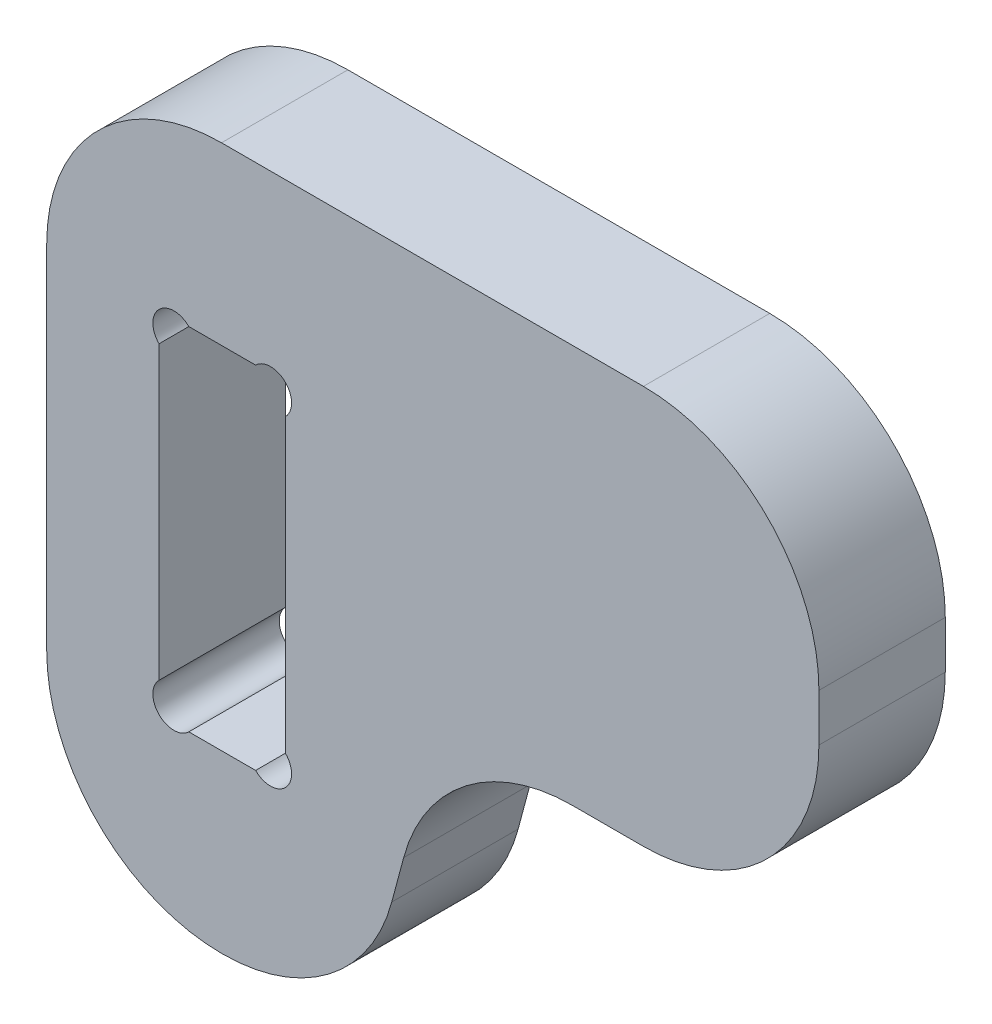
ISO-10303-21;
HEADER;
FILE_DESCRIPTION(('STEP AP214'),'2;1');
FILE_NAME('part.step','',(''),(''),'','','');
FILE_SCHEMA(('AUTOMOTIVE_DESIGN { 1 0 10303 214 1 1 1 1 }'));
ENDSEC;
DATA;
#1=APPLICATION_CONTEXT('core data for automotive mechanical design processes');
#2=APPLICATION_PROTOCOL_DEFINITION('international standard','automotive_design',2000,#1);
#3=PRODUCT_CONTEXT('',#1,'mechanical');
#4=PRODUCT('Part','Part','',(#3));
#5=PRODUCT_RELATED_PRODUCT_CATEGORY('part','',(#4));
#6=PRODUCT_DEFINITION_FORMATION('','',#4);
#7=PRODUCT_DEFINITION_CONTEXT('part definition',#1,'design');
#8=PRODUCT_DEFINITION('design','',#6,#7);
#9=PRODUCT_DEFINITION_SHAPE('','',#8);
#10=(LENGTH_UNIT() NAMED_UNIT(*) SI_UNIT(.MILLI.,.METRE.));
#11=(NAMED_UNIT(*) PLANE_ANGLE_UNIT() SI_UNIT($,.RADIAN.));
#12=(NAMED_UNIT(*) SI_UNIT($,.STERADIAN.) SOLID_ANGLE_UNIT());
#13=UNCERTAINTY_MEASURE_WITH_UNIT(LENGTH_MEASURE(1.E-05),#10,'distance_accuracy_value','');
#14=(GEOMETRIC_REPRESENTATION_CONTEXT(3) GLOBAL_UNCERTAINTY_ASSIGNED_CONTEXT((#13)) GLOBAL_UNIT_ASSIGNED_CONTEXT((#10,
#11,#12)) REPRESENTATION_CONTEXT('',''));
#15=CARTESIAN_POINT('',(0.,0.,0.));
#16=DIRECTION('',(0.,0.,1.));
#17=DIRECTION('',(1.,0.,0.));
#18=AXIS2_PLACEMENT_3D('',#15,#16,#17);
#19=CARTESIAN_POINT('',(24.9,-25.1,18.));
#20=DIRECTION('',(0.,0.,-1.));
#21=DIRECTION('',(-1.,0.,0.));
#22=AXIS2_PLACEMENT_3D('',#19,#20,#21);
#23=CYLINDRICAL_SURFACE('',#22,24.9);
#24=CARTESIAN_POINT('',(24.9,-25.1,0.));
#25=DIRECTION('',(0.,0.,1.));
#26=DIRECTION('',(-1.,0.,0.));
#27=AXIS2_PLACEMENT_3D('',#24,#25,#26);
#28=CIRCLE('',#27,24.9);
#29=CARTESIAN_POINT('',(0.,-25.1,0.));
#30=VERTEX_POINT('',#29);
#31=CARTESIAN_POINT('',(24.9000000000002,-50.,0.));
#32=VERTEX_POINT('',#31);
#33=EDGE_CURVE('E237',#30,#32,#28,.T.);
#34=ORIENTED_EDGE('',*,*,#33,.T.);
#35=DIRECTION('',(0.,0.,-1.));
#36=VECTOR('',#35,1.);
#37=CARTESIAN_POINT('',(24.9000000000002,-50.,18.));
#38=LINE('',#37,#36);
#39=CARTESIAN_POINT('',(24.9000000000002,-50.,18.));
#40=VERTEX_POINT('',#39);
#41=EDGE_CURVE('E276',#40,#32,#38,.T.);
#42=ORIENTED_EDGE('',*,*,#41,.F.);
#43=CARTESIAN_POINT('',(24.9,-25.1,18.));
#44=DIRECTION('',(0.,0.,1.));
#45=DIRECTION('',(-1.,0.,0.));
#46=AXIS2_PLACEMENT_3D('',#43,#44,#45);
#47=CIRCLE('',#46,24.9);
#48=CARTESIAN_POINT('',(0.,-25.1,18.));
#49=VERTEX_POINT('',#48);
#50=EDGE_CURVE('E214',#49,#40,#47,.T.);
#51=ORIENTED_EDGE('',*,*,#50,.F.);
#52=DIRECTION('',(0.,0.,-1.));
#53=VECTOR('',#52,1.);
#54=CARTESIAN_POINT('',(0.,-25.1,18.));
#55=LINE('',#54,#53);
#56=EDGE_CURVE('E279',#49,#30,#55,.T.);
#57=ORIENTED_EDGE('',*,*,#56,.T.);
#58=EDGE_LOOP('',(#34,#42,#51,#57));
#59=FACE_BOUND('',#58,.T.);
#60=ADVANCED_FACE('F33',(#59),#23,.T.);
#61=CARTESIAN_POINT('',(24.9000000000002,-50.,18.));
#62=DIRECTION('',(0.,1.,0.));
#63=DIRECTION('',(0.,0.,1.));
#64=AXIS2_PLACEMENT_3D('',#61,#62,#63);
#65=PLANE('',#64);
#66=DIRECTION('',(1.,0.,0.));
#67=VECTOR('',#66,1.);
#68=CARTESIAN_POINT('',(24.9000000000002,-50.,0.));
#69=LINE('',#68,#67);
#70=CARTESIAN_POINT('',(25.0999999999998,-50.,0.));
#71=VERTEX_POINT('',#70);
#72=EDGE_CURVE('E239',#32,#71,#69,.T.);
#73=ORIENTED_EDGE('',*,*,#72,.T.);
#74=DIRECTION('',(0.,0.,-1.));
#75=VECTOR('',#74,1.);
#76=CARTESIAN_POINT('',(25.0999999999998,-50.,18.));
#77=LINE('',#76,#75);
#78=CARTESIAN_POINT('',(25.0999999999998,-50.,18.));
#79=VERTEX_POINT('',#78);
#80=EDGE_CURVE('E273',#79,#71,#77,.T.);
#81=ORIENTED_EDGE('',*,*,#80,.F.);
#82=DIRECTION('',(1.,0.,0.));
#83=VECTOR('',#82,1.);
#84=CARTESIAN_POINT('',(24.9000000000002,-50.,18.));
#85=LINE('',#84,#83);
#86=EDGE_CURVE('E217',#40,#79,#85,.T.);
#87=ORIENTED_EDGE('',*,*,#86,.F.);
#88=ORIENTED_EDGE('',*,*,#41,.T.);
#89=EDGE_LOOP('',(#73,#81,#87,#88));
#90=FACE_BOUND('',#89,.T.);
#91=ADVANCED_FACE('F354',(#90),#65,.F.);
#92=CARTESIAN_POINT('',(25.1,-25.1,18.));
#93=DIRECTION('',(0.,0.,-1.));
#94=DIRECTION('',(-1.,0.,0.));
#95=AXIS2_PLACEMENT_3D('',#92,#93,#94);
#96=CYLINDRICAL_SURFACE('',#95,24.9);
#97=CARTESIAN_POINT('',(25.1,-25.1,0.));
#98=DIRECTION('',(0.,0.,1.));
#99=DIRECTION('',(1.,0.,0.));
#100=AXIS2_PLACEMENT_3D('',#97,#98,#99);
#101=CIRCLE('',#100,24.9);
#102=CARTESIAN_POINT('',(49.1520859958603,-31.5426050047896,0.));
#103=VERTEX_POINT('',#102);
#104=EDGE_CURVE('E242',#71,#103,#101,.T.);
#105=ORIENTED_EDGE('',*,*,#104,.T.);
#106=DIRECTION('',(0.,0.,-1.));
#107=VECTOR('',#106,1.);
#108=CARTESIAN_POINT('',(49.1520859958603,-31.5426050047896,18.));
#109=LINE('',#108,#107);
#110=CARTESIAN_POINT('',(49.1520859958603,-31.5426050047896,18.));
#111=VERTEX_POINT('',#110);
#112=EDGE_CURVE('E270',#111,#103,#109,.T.);
#113=ORIENTED_EDGE('',*,*,#112,.F.);
#114=CARTESIAN_POINT('',(25.1,-25.1,18.));
#115=DIRECTION('',(0.,0.,1.));
#116=DIRECTION('',(1.,0.,0.));
#117=AXIS2_PLACEMENT_3D('',#114,#115,#116);
#118=CIRCLE('',#117,24.9);
#119=EDGE_CURVE('E219',#79,#111,#118,.T.);
#120=ORIENTED_EDGE('',*,*,#119,.F.);
#121=ORIENTED_EDGE('',*,*,#80,.T.);
#122=EDGE_LOOP('',(#105,#113,#120,#121));
#123=FACE_BOUND('',#122,.T.);
#124=ADVANCED_FACE('F360',(#123),#96,.T.);
#125=CARTESIAN_POINT('',(49.1520859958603,-31.5426050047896,18.));
#126=DIRECTION('',(-0.965947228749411,0.258739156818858,0.));
#127=DIRECTION('',(-0.258739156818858,-0.965947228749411,0.));
#128=AXIS2_PLACEMENT_3D('',#125,#126,#127);
#129=PLANE('',#128);
#130=DIRECTION('',(0.258739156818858,0.965947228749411,0.));
#131=VECTOR('',#130,1.);
#132=CARTESIAN_POINT('',(49.1520859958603,-31.5426050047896,0.));
#133=LINE('',#132,#131);
#134=CARTESIAN_POINT('',(50.8479140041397,-25.2115943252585,0.));
#135=VERTEX_POINT('',#134);
#136=EDGE_CURVE('E244',#103,#135,#133,.T.);
#137=ORIENTED_EDGE('',*,*,#136,.T.);
#138=DIRECTION('',(0.,0.,-1.));
#139=VECTOR('',#138,1.);
#140=CARTESIAN_POINT('',(50.8479140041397,-25.2115943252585,18.));
#141=LINE('',#140,#139);
#142=CARTESIAN_POINT('',(50.8479140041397,-25.2115943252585,18.));
#143=VERTEX_POINT('',#142);
#144=EDGE_CURVE('E267',#143,#135,#141,.T.);
#145=ORIENTED_EDGE('',*,*,#144,.F.);
#146=DIRECTION('',(0.258739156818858,0.965947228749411,0.));
#147=VECTOR('',#146,1.);
#148=CARTESIAN_POINT('',(49.1520859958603,-31.5426050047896,18.));
#149=LINE('',#148,#147);
#150=EDGE_CURVE('E221',#111,#143,#149,.T.);
#151=ORIENTED_EDGE('',*,*,#150,.F.);
#152=ORIENTED_EDGE('',*,*,#112,.T.);
#153=EDGE_LOOP('',(#137,#145,#151,#152));
#154=FACE_BOUND('',#153,.T.);
#155=ADVANCED_FACE('F412',(#154),#129,.F.);
#156=CARTESIAN_POINT('',(74.9,-31.654199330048,18.));
#157=DIRECTION('',(0.,0.,-1.));
#158=DIRECTION('',(-1.,0.,0.));
#159=AXIS2_PLACEMENT_3D('',#156,#157,#158);
#160=CYLINDRICAL_SURFACE('',#159,24.9);
#161=CARTESIAN_POINT('',(74.9,-31.654199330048,0.));
#162=DIRECTION('',(0.,0.,-1.));
#163=DIRECTION('',(1.,0.,0.));
#164=AXIS2_PLACEMENT_3D('',#161,#162,#163);
#165=CIRCLE('',#164,24.9);
#166=CARTESIAN_POINT('',(74.9,-6.75419933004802,0.));
#167=VERTEX_POINT('',#166);
#168=EDGE_CURVE('E246',#135,#167,#165,.T.);
#169=ORIENTED_EDGE('',*,*,#168,.T.);
#170=DIRECTION('',(0.,0.,-1.));
#171=VECTOR('',#170,1.);
#172=CARTESIAN_POINT('',(74.9,-6.75419933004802,18.));
#173=LINE('',#172,#171);
#174=CARTESIAN_POINT('',(74.9,-6.75419933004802,18.));
#175=VERTEX_POINT('',#174);
#176=EDGE_CURVE('E264',#175,#167,#173,.T.);
#177=ORIENTED_EDGE('',*,*,#176,.F.);
#178=CARTESIAN_POINT('',(74.9,-31.654199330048,18.));
#179=DIRECTION('',(0.,0.,-1.));
#180=DIRECTION('',(1.,0.,0.));
#181=AXIS2_PLACEMENT_3D('',#178,#179,#180);
#182=CIRCLE('',#181,24.9);
#183=EDGE_CURVE('E223',#143,#175,#182,.T.);
#184=ORIENTED_EDGE('',*,*,#183,.F.);
#185=ORIENTED_EDGE('',*,*,#144,.T.);
#186=EDGE_LOOP('',(#169,#177,#184,#185));
#187=FACE_BOUND('',#186,.T.);
#188=ADVANCED_FACE('F417',(#187),#160,.F.);
#189=CARTESIAN_POINT('',(74.9,-6.75419933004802,18.));
#190=DIRECTION('',(0.,1.,0.));
#191=DIRECTION('',(0.,0.,1.));
#192=AXIS2_PLACEMENT_3D('',#189,#190,#191);
#193=PLANE('',#192);
#194=DIRECTION('',(1.,0.,0.));
#195=VECTOR('',#194,1.);
#196=CARTESIAN_POINT('',(74.9,-6.75419933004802,0.));
#197=LINE('',#196,#195);
#198=CARTESIAN_POINT('',(85.,-6.75419933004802,0.));
#199=VERTEX_POINT('',#198);
#200=EDGE_CURVE('E248',#167,#199,#197,.T.);
#201=ORIENTED_EDGE('',*,*,#200,.T.);
#202=DIRECTION('',(0.,0.,-1.));
#203=VECTOR('',#202,1.);
#204=CARTESIAN_POINT('',(85.,-6.75419933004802,18.));
#205=LINE('',#204,#203);
#206=CARTESIAN_POINT('',(85.,-6.75419933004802,18.));
#207=VERTEX_POINT('',#206);
#208=EDGE_CURVE('E291',#199,#207,#205,.F.);
#209=ORIENTED_EDGE('',*,*,#208,.T.);
#210=DIRECTION('',(1.,0.,0.));
#211=VECTOR('',#210,1.);
#212=CARTESIAN_POINT('',(74.9,-6.75419933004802,18.));
#213=LINE('',#212,#211);
#214=EDGE_CURVE('E225',#175,#207,#213,.T.);
#215=ORIENTED_EDGE('',*,*,#214,.F.);
#216=ORIENTED_EDGE('',*,*,#176,.T.);
#217=EDGE_LOOP('',(#201,#209,#215,#216));
#218=FACE_BOUND('',#217,.T.);
#219=ADVANCED_FACE('F420',(#218),#193,.F.);
#220=CARTESIAN_POINT('',(110.,50.,18.));
#221=DIRECTION('',(-1.,0.,0.));
#222=DIRECTION('',(0.,-1.,0.));
#223=AXIS2_PLACEMENT_3D('',#220,#221,#222);
#224=PLANE('',#223);
#225=DIRECTION('',(0.,1.,0.));
#226=VECTOR('',#225,1.);
#227=CARTESIAN_POINT('',(110.,50.,18.));
#228=LINE('',#227,#226);
#229=CARTESIAN_POINT('',(110.,18.245800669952,18.));
#230=VERTEX_POINT('',#229);
#231=CARTESIAN_POINT('',(110.,25.,18.));
#232=VERTEX_POINT('',#231);
#233=EDGE_CURVE('E228',#230,#232,#228,.T.);
#234=ORIENTED_EDGE('',*,*,#233,.F.);
#235=DIRECTION('',(0.,0.,-1.));
#236=VECTOR('',#235,1.);
#237=CARTESIAN_POINT('',(110.,18.245800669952,18.));
#238=LINE('',#237,#236);
#239=CARTESIAN_POINT('',(110.,18.245800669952,0.));
#240=VERTEX_POINT('',#239);
#241=EDGE_CURVE('E284',#230,#240,#238,.T.);
#242=ORIENTED_EDGE('',*,*,#241,.T.);
#243=DIRECTION('',(0.,1.,0.));
#244=VECTOR('',#243,1.);
#245=CARTESIAN_POINT('',(110.,50.,0.));
#246=LINE('',#245,#244);
#247=CARTESIAN_POINT('',(110.,25.,0.));
#248=VERTEX_POINT('',#247);
#249=EDGE_CURVE('E251',#240,#248,#246,.T.);
#250=ORIENTED_EDGE('',*,*,#249,.T.);
#251=DIRECTION('',(0.,0.,-1.));
#252=VECTOR('',#251,1.);
#253=CARTESIAN_POINT('',(110.,25.,18.));
#254=LINE('',#253,#252);
#255=EDGE_CURVE('E282',#248,#232,#254,.F.);
#256=ORIENTED_EDGE('',*,*,#255,.T.);
#257=EDGE_LOOP('',(#234,#242,#250,#256));
#258=FACE_BOUND('',#257,.T.);
#259=ADVANCED_FACE('F381',(#258),#224,.F.);
#260=CARTESIAN_POINT('',(24.9000000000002,50.,18.));
#261=DIRECTION('',(0.,-1.,0.));
#262=DIRECTION('',(1.,0.,0.));
#263=AXIS2_PLACEMENT_3D('',#260,#261,#262);
#264=PLANE('',#263);
#265=DIRECTION('',(-1.,0.,0.));
#266=VECTOR('',#265,1.);
#267=CARTESIAN_POINT('',(24.9000000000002,50.,18.));
#268=LINE('',#267,#266);
#269=CARTESIAN_POINT('',(85.,50.,18.));
#270=VERTEX_POINT('',#269);
#271=CARTESIAN_POINT('',(24.9000000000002,50.,18.));
#272=VERTEX_POINT('',#271);
#273=EDGE_CURVE('E231',#270,#272,#268,.T.);
#274=ORIENTED_EDGE('',*,*,#273,.F.);
#275=DIRECTION('',(0.,0.,-1.));
#276=VECTOR('',#275,1.);
#277=CARTESIAN_POINT('',(85.,50.,18.));
#278=LINE('',#277,#276);
#279=CARTESIAN_POINT('',(85.,50.,0.));
#280=VERTEX_POINT('',#279);
#281=EDGE_CURVE('E182',#270,#280,#278,.T.);
#282=ORIENTED_EDGE('',*,*,#281,.T.);
#283=DIRECTION('',(-1.,0.,0.));
#284=VECTOR('',#283,1.);
#285=CARTESIAN_POINT('',(24.9000000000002,50.,0.));
#286=LINE('',#285,#284);
#287=CARTESIAN_POINT('',(24.9000000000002,50.,0.));
#288=VERTEX_POINT('',#287);
#289=EDGE_CURVE('E254',#280,#288,#286,.T.);
#290=ORIENTED_EDGE('',*,*,#289,.T.);
#291=DIRECTION('',(0.,0.,-1.));
#292=VECTOR('',#291,1.);
#293=CARTESIAN_POINT('',(24.9000000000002,50.,18.));
#294=LINE('',#293,#292);
#295=EDGE_CURVE('E261',#272,#288,#294,.T.);
#296=ORIENTED_EDGE('',*,*,#295,.F.);
#297=EDGE_LOOP('',(#274,#282,#290,#296));
#298=FACE_BOUND('',#297,.T.);
#299=ADVANCED_FACE('F388',(#298),#264,.F.);
#300=CARTESIAN_POINT('',(24.9,25.1,18.));
#301=DIRECTION('',(0.,0.,-1.));
#302=DIRECTION('',(-1.,0.,0.));
#303=AXIS2_PLACEMENT_3D('',#300,#301,#302);
#304=CYLINDRICAL_SURFACE('',#303,24.9);
#305=CARTESIAN_POINT('',(24.9,25.1,0.));
#306=DIRECTION('',(0.,0.,1.));
#307=DIRECTION('',(-1.,0.,0.));
#308=AXIS2_PLACEMENT_3D('',#305,#306,#307);
#309=CIRCLE('',#308,24.9);
#310=CARTESIAN_POINT('',(0.,25.0999999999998,0.));
#311=VERTEX_POINT('',#310);
#312=EDGE_CURVE('E256',#288,#311,#309,.T.);
#313=ORIENTED_EDGE('',*,*,#312,.T.);
#314=DIRECTION('',(0.,0.,-1.));
#315=VECTOR('',#314,1.);
#316=CARTESIAN_POINT('',(0.,25.0999999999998,18.));
#317=LINE('',#316,#315);
#318=CARTESIAN_POINT('',(0.,25.0999999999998,18.));
#319=VERTEX_POINT('',#318);
#320=EDGE_CURVE('E236',#319,#311,#317,.T.);
#321=ORIENTED_EDGE('',*,*,#320,.F.);
#322=CARTESIAN_POINT('',(24.9,25.1,18.));
#323=DIRECTION('',(0.,0.,1.));
#324=DIRECTION('',(-1.,0.,0.));
#325=AXIS2_PLACEMENT_3D('',#322,#323,#324);
#326=CIRCLE('',#325,24.9);
#327=EDGE_CURVE('E233',#272,#319,#326,.T.);
#328=ORIENTED_EDGE('',*,*,#327,.F.);
#329=ORIENTED_EDGE('',*,*,#295,.T.);
#330=EDGE_LOOP('',(#313,#321,#328,#329));
#331=FACE_BOUND('',#330,.T.);
#332=ADVANCED_FACE('F394',(#331),#304,.T.);
#333=CARTESIAN_POINT('',(0.,0.,18.));
#334=DIRECTION('',(1.,0.,0.));
#335=DIRECTION('',(0.,0.,-1.));
#336=AXIS2_PLACEMENT_3D('',#333,#334,#335);
#337=PLANE('',#336);
#338=DIRECTION('',(0.,-1.,0.));
#339=VECTOR('',#338,1.);
#340=CARTESIAN_POINT('',(0.,0.,0.));
#341=LINE('',#340,#339);
#342=EDGE_CURVE('E215',#311,#30,#341,.T.);
#343=ORIENTED_EDGE('',*,*,#342,.T.);
#344=ORIENTED_EDGE('',*,*,#56,.F.);
#345=DIRECTION('',(0.,-1.,0.));
#346=VECTOR('',#345,1.);
#347=CARTESIAN_POINT('',(0.,0.,18.));
#348=LINE('',#347,#346);
#349=EDGE_CURVE('E211',#319,#49,#348,.T.);
#350=ORIENTED_EDGE('',*,*,#349,.F.);
#351=ORIENTED_EDGE('',*,*,#320,.T.);
#352=EDGE_LOOP('',(#343,#344,#350,#351));
#353=FACE_BOUND('',#352,.T.);
#354=ADVANCED_FACE('F398',(#353),#337,.F.);
#355=CARTESIAN_POINT('',(24.9,-25.1,18.));
#356=DIRECTION('',(0.,0.,-1.));
#357=DIRECTION('',(-1.,0.,0.));
#358=AXIS2_PLACEMENT_3D('',#355,#356,#357);
#359=PLANE('',#358);
#360=DIRECTION('',(1.,0.,0.));
#361=VECTOR('',#360,1.);
#362=CARTESIAN_POINT('',(0.,-25.,18.));
#363=LINE('',#362,#361);
#364=CARTESIAN_POINT('',(20.2426406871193,-25.,18.));
#365=VERTEX_POINT('',#364);
#366=CARTESIAN_POINT('',(29.7573593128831,-25.,18.));
#367=VERTEX_POINT('',#366);
#368=EDGE_CURVE('E199',#365,#367,#363,.T.);
#369=ORIENTED_EDGE('',*,*,#368,.F.);
#370=CARTESIAN_POINT('',(18.1213203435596,-22.8786796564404,18.));
#371=DIRECTION('',(0.,0.,1.));
#372=DIRECTION('',(-1.,0.,0.));
#373=AXIS2_PLACEMENT_3D('',#370,#371,#372);
#374=CIRCLE('',#373,3.);
#375=CARTESIAN_POINT('',(16.,-20.7573593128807,18.));
#376=VERTEX_POINT('',#375);
#377=EDGE_CURVE('E338',#376,#365,#374,.T.);
#378=ORIENTED_EDGE('',*,*,#377,.F.);
#379=DIRECTION('',(0.,1.,0.));
#380=VECTOR('',#379,1.);
#381=CARTESIAN_POINT('',(16.,0.,18.));
#382=LINE('',#381,#380);
#383=CARTESIAN_POINT('',(16.,20.7573593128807,18.));
#384=VERTEX_POINT('',#383);
#385=EDGE_CURVE('E201',#376,#384,#382,.T.);
#386=ORIENTED_EDGE('',*,*,#385,.T.);
#387=CARTESIAN_POINT('',(18.1213203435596,22.8786796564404,18.));
#388=DIRECTION('',(0.,0.,1.));
#389=DIRECTION('',(1.,0.,0.));
#390=AXIS2_PLACEMENT_3D('',#387,#388,#389);
#391=CIRCLE('',#390,3.);
#392=CARTESIAN_POINT('',(20.2426406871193,25.,18.));
#393=VERTEX_POINT('',#392);
#394=EDGE_CURVE('E300',#393,#384,#391,.T.);
#395=ORIENTED_EDGE('',*,*,#394,.F.);
#396=DIRECTION('',(1.,0.,0.));
#397=VECTOR('',#396,1.);
#398=CARTESIAN_POINT('',(0.,25.,18.));
#399=LINE('',#398,#397);
#400=CARTESIAN_POINT('',(29.7573593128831,25.,18.));
#401=VERTEX_POINT('',#400);
#402=EDGE_CURVE('E193',#393,#401,#399,.T.);
#403=ORIENTED_EDGE('',*,*,#402,.T.);
#404=CARTESIAN_POINT('',(31.8786796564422,22.8786796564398,18.));
#405=DIRECTION('',(0.,0.,1.));
#406=DIRECTION('',(-1.,0.,0.));
#407=AXIS2_PLACEMENT_3D('',#404,#405,#406);
#408=CIRCLE('',#407,3.);
#409=CARTESIAN_POINT('',(34.,20.7573593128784,18.));
#410=VERTEX_POINT('',#409);
#411=EDGE_CURVE('E174',#410,#401,#408,.T.);
#412=ORIENTED_EDGE('',*,*,#411,.F.);
#413=DIRECTION('',(0.,1.,0.));
#414=VECTOR('',#413,1.);
#415=CARTESIAN_POINT('',(34.,0.,18.));
#416=LINE('',#415,#414);
#417=CARTESIAN_POINT('',(34.,-20.7573593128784,18.));
#418=VERTEX_POINT('',#417);
#419=EDGE_CURVE('E191',#418,#410,#416,.T.);
#420=ORIENTED_EDGE('',*,*,#419,.F.);
#421=CARTESIAN_POINT('',(31.8786796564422,-22.8786796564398,18.));
#422=DIRECTION('',(0.,0.,1.));
#423=DIRECTION('',(1.,0.,0.));
#424=AXIS2_PLACEMENT_3D('',#421,#422,#423);
#425=CIRCLE('',#424,3.);
#426=EDGE_CURVE('E335',#367,#418,#425,.T.);
#427=ORIENTED_EDGE('',*,*,#426,.F.);
#428=EDGE_LOOP('',(#369,#378,#386,#395,#403,#412,#420,#427));
#429=FACE_BOUND('',#428,.T.);
#430=ORIENTED_EDGE('',*,*,#214,.T.);
#431=CARTESIAN_POINT('',(85.,18.245800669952,18.));
#432=DIRECTION('',(0.,0.,-1.));
#433=DIRECTION('',(-1.,0.,0.));
#434=AXIS2_PLACEMENT_3D('',#431,#432,#433);
#435=CIRCLE('',#434,25.);
#436=EDGE_CURVE('E295',#207,#230,#435,.F.);
#437=ORIENTED_EDGE('',*,*,#436,.T.);
#438=ORIENTED_EDGE('',*,*,#233,.T.);
#439=CARTESIAN_POINT('',(85.,25.,18.));
#440=DIRECTION('',(0.,0.,-1.));
#441=DIRECTION('',(-1.,0.,0.));
#442=AXIS2_PLACEMENT_3D('',#439,#440,#441);
#443=CIRCLE('',#442,25.);
#444=EDGE_CURVE('E293',#232,#270,#443,.F.);
#445=ORIENTED_EDGE('',*,*,#444,.T.);
#446=ORIENTED_EDGE('',*,*,#273,.T.);
#447=ORIENTED_EDGE('',*,*,#327,.T.);
#448=ORIENTED_EDGE('',*,*,#349,.T.);
#449=ORIENTED_EDGE('',*,*,#50,.T.);
#450=ORIENTED_EDGE('',*,*,#86,.T.);
#451=ORIENTED_EDGE('',*,*,#119,.T.);
#452=ORIENTED_EDGE('',*,*,#150,.T.);
#453=ORIENTED_EDGE('',*,*,#183,.T.);
#454=EDGE_LOOP('',(#430,#437,#438,#445,#446,#447,#448,#449,#450,#451,#452,#453));
#455=FACE_BOUND('',#454,.T.);
#456=ADVANCED_FACE('F188',(#429,#455),#359,.F.);
#457=CARTESIAN_POINT('',(24.9,-25.1,0.));
#458=DIRECTION('',(0.,0.,-1.));
#459=DIRECTION('',(-1.,0.,0.));
#460=AXIS2_PLACEMENT_3D('',#457,#458,#459);
#461=PLANE('',#460);
#462=CARTESIAN_POINT('',(18.1213203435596,-22.8786796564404,0.));
#463=DIRECTION('',(0.,0.,1.));
#464=DIRECTION('',(-1.,0.,0.));
#465=AXIS2_PLACEMENT_3D('',#462,#463,#464);
#466=CIRCLE('',#465,3.);
#467=CARTESIAN_POINT('',(16.,-20.7573593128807,0.));
#468=VERTEX_POINT('',#467);
#469=CARTESIAN_POINT('',(20.2426406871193,-25.,0.));
#470=VERTEX_POINT('',#469);
#471=EDGE_CURVE('E47',#468,#470,#466,.T.);
#472=ORIENTED_EDGE('',*,*,#471,.T.);
#473=DIRECTION('',(1.,0.,0.));
#474=VECTOR('',#473,1.);
#475=CARTESIAN_POINT('',(0.,-25.,0.));
#476=LINE('',#475,#474);
#477=CARTESIAN_POINT('',(29.7573593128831,-25.,0.));
#478=VERTEX_POINT('',#477);
#479=EDGE_CURVE('E210',#470,#478,#476,.T.);
#480=ORIENTED_EDGE('',*,*,#479,.T.);
#481=CARTESIAN_POINT('',(31.8786796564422,-22.8786796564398,0.));
#482=DIRECTION('',(0.,0.,1.));
#483=DIRECTION('',(1.,0.,0.));
#484=AXIS2_PLACEMENT_3D('',#481,#482,#483);
#485=CIRCLE('',#484,3.);
#486=CARTESIAN_POINT('',(34.,-20.7573593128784,0.));
#487=VERTEX_POINT('',#486);
#488=EDGE_CURVE('E194',#478,#487,#485,.T.);
#489=ORIENTED_EDGE('',*,*,#488,.T.);
#490=DIRECTION('',(0.,1.,0.));
#491=VECTOR('',#490,1.);
#492=CARTESIAN_POINT('',(34.,0.,0.));
#493=LINE('',#492,#491);
#494=CARTESIAN_POINT('',(34.,20.7573593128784,0.));
#495=VERTEX_POINT('',#494);
#496=EDGE_CURVE('E321',#487,#495,#493,.T.);
#497=ORIENTED_EDGE('',*,*,#496,.T.);
#498=CARTESIAN_POINT('',(31.8786796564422,22.8786796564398,0.));
#499=DIRECTION('',(0.,0.,1.));
#500=DIRECTION('',(-1.,0.,0.));
#501=AXIS2_PLACEMENT_3D('',#498,#499,#500);
#502=CIRCLE('',#501,3.);
#503=CARTESIAN_POINT('',(29.7573593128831,25.,0.));
#504=VERTEX_POINT('',#503);
#505=EDGE_CURVE('E176',#495,#504,#502,.T.);
#506=ORIENTED_EDGE('',*,*,#505,.T.);
#507=DIRECTION('',(1.,0.,0.));
#508=VECTOR('',#507,1.);
#509=CARTESIAN_POINT('',(0.,25.,0.));
#510=LINE('',#509,#508);
#511=CARTESIAN_POINT('',(20.2426406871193,25.,0.));
#512=VERTEX_POINT('',#511);
#513=EDGE_CURVE('E307',#512,#504,#510,.T.);
#514=ORIENTED_EDGE('',*,*,#513,.F.);
#515=CARTESIAN_POINT('',(18.1213203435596,22.8786796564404,0.));
#516=DIRECTION('',(0.,0.,1.));
#517=DIRECTION('',(1.,0.,0.));
#518=AXIS2_PLACEMENT_3D('',#515,#516,#517);
#519=CIRCLE('',#518,3.);
#520=CARTESIAN_POINT('',(16.,20.7573593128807,0.));
#521=VERTEX_POINT('',#520);
#522=EDGE_CURVE('E55',#512,#521,#519,.T.);
#523=ORIENTED_EDGE('',*,*,#522,.T.);
#524=DIRECTION('',(0.,1.,0.));
#525=VECTOR('',#524,1.);
#526=CARTESIAN_POINT('',(16.,0.,0.));
#527=LINE('',#526,#525);
#528=EDGE_CURVE('E240',#468,#521,#527,.T.);
#529=ORIENTED_EDGE('',*,*,#528,.F.);
#530=EDGE_LOOP('',(#472,#480,#489,#497,#506,#514,#523,#529));
#531=FACE_BOUND('',#530,.T.);
#532=ORIENTED_EDGE('',*,*,#249,.F.);
#533=CARTESIAN_POINT('',(85.,18.245800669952,0.));
#534=DIRECTION('',(0.,0.,-1.));
#535=DIRECTION('',(-1.,0.,0.));
#536=AXIS2_PLACEMENT_3D('',#533,#534,#535);
#537=CIRCLE('',#536,25.);
#538=EDGE_CURVE('E289',#240,#199,#537,.T.);
#539=ORIENTED_EDGE('',*,*,#538,.T.);
#540=ORIENTED_EDGE('',*,*,#200,.F.);
#541=ORIENTED_EDGE('',*,*,#168,.F.);
#542=ORIENTED_EDGE('',*,*,#136,.F.);
#543=ORIENTED_EDGE('',*,*,#104,.F.);
#544=ORIENTED_EDGE('',*,*,#72,.F.);
#545=ORIENTED_EDGE('',*,*,#33,.F.);
#546=ORIENTED_EDGE('',*,*,#342,.F.);
#547=ORIENTED_EDGE('',*,*,#312,.F.);
#548=ORIENTED_EDGE('',*,*,#289,.F.);
#549=CARTESIAN_POINT('',(85.,25.,0.));
#550=DIRECTION('',(0.,0.,-1.));
#551=DIRECTION('',(-1.,0.,0.));
#552=AXIS2_PLACEMENT_3D('',#549,#550,#551);
#553=CIRCLE('',#552,25.);
#554=EDGE_CURVE('E287',#280,#248,#553,.T.);
#555=ORIENTED_EDGE('',*,*,#554,.T.);
#556=EDGE_LOOP('',(#532,#539,#540,#541,#542,#543,#544,#545,#546,#547,#548,#555));
#557=FACE_BOUND('',#556,.T.);
#558=ADVANCED_FACE('F329',(#531,#557),#461,.T.);
#559=CARTESIAN_POINT('',(85.,18.245800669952,18.));
#560=DIRECTION('',(0.,0.,-1.));
#561=DIRECTION('',(-1.,0.,0.));
#562=AXIS2_PLACEMENT_3D('',#559,#560,#561);
#563=CYLINDRICAL_SURFACE('',#562,25.);
#564=ORIENTED_EDGE('',*,*,#436,.F.);
#565=ORIENTED_EDGE('',*,*,#208,.F.);
#566=ORIENTED_EDGE('',*,*,#538,.F.);
#567=ORIENTED_EDGE('',*,*,#241,.F.);
#568=EDGE_LOOP('',(#564,#565,#566,#567));
#569=FACE_BOUND('',#568,.T.);
#570=ADVANCED_FACE('F364',(#569),#563,.T.);
#571=CARTESIAN_POINT('',(85.,25.,18.));
#572=DIRECTION('',(0.,0.,-1.));
#573=DIRECTION('',(-1.,0.,0.));
#574=AXIS2_PLACEMENT_3D('',#571,#572,#573);
#575=CYLINDRICAL_SURFACE('',#574,25.);
#576=ORIENTED_EDGE('',*,*,#444,.F.);
#577=ORIENTED_EDGE('',*,*,#255,.F.);
#578=ORIENTED_EDGE('',*,*,#554,.F.);
#579=ORIENTED_EDGE('',*,*,#281,.F.);
#580=EDGE_LOOP('',(#576,#577,#578,#579));
#581=FACE_BOUND('',#580,.T.);
#582=ADVANCED_FACE('F35',(#581),#575,.T.);
#583=CARTESIAN_POINT('',(0.,-25.,0.));
#584=DIRECTION('',(0.,-1.,0.));
#585=DIRECTION('',(0.,0.,-1.));
#586=AXIS2_PLACEMENT_3D('',#583,#584,#585);
#587=PLANE('',#586);
#588=ORIENTED_EDGE('',*,*,#479,.F.);
#589=DIRECTION('',(0.,0.,1.));
#590=VECTOR('',#589,1.);
#591=CARTESIAN_POINT('',(20.2426406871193,-25.,0.));
#592=LINE('',#591,#590);
#593=EDGE_CURVE('E204',#470,#365,#592,.T.);
#594=ORIENTED_EDGE('',*,*,#593,.T.);
#595=ORIENTED_EDGE('',*,*,#368,.T.);
#596=DIRECTION('',(0.,0.,1.));
#597=VECTOR('',#596,1.);
#598=CARTESIAN_POINT('',(29.7573593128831,-25.,0.));
#599=LINE('',#598,#597);
#600=EDGE_CURVE('E308',#367,#478,#599,.F.);
#601=ORIENTED_EDGE('',*,*,#600,.T.);
#602=EDGE_LOOP('',(#588,#594,#595,#601));
#603=FACE_BOUND('',#602,.T.);
#604=ADVANCED_FACE('F341',(#603),#587,.F.);
#605=CARTESIAN_POINT('',(16.,0.,0.));
#606=DIRECTION('',(1.,0.,0.));
#607=DIRECTION('',(0.,0.,-1.));
#608=AXIS2_PLACEMENT_3D('',#605,#606,#607);
#609=PLANE('',#608);
#610=DIRECTION('',(0.,0.,1.));
#611=VECTOR('',#610,1.);
#612=CARTESIAN_POINT('',(16.,-20.7573593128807,0.));
#613=LINE('',#612,#611);
#614=EDGE_CURVE('E11',#468,#376,#613,.T.);
#615=ORIENTED_EDGE('',*,*,#614,.F.);
#616=ORIENTED_EDGE('',*,*,#528,.T.);
#617=DIRECTION('',(0.,0.,1.));
#618=VECTOR('',#617,1.);
#619=CARTESIAN_POINT('',(16.,20.7573593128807,0.));
#620=LINE('',#619,#618);
#621=EDGE_CURVE('E311',#384,#521,#620,.F.);
#622=ORIENTED_EDGE('',*,*,#621,.F.);
#623=ORIENTED_EDGE('',*,*,#385,.F.);
#624=EDGE_LOOP('',(#615,#616,#622,#623));
#625=FACE_BOUND('',#624,.T.);
#626=ADVANCED_FACE('F326',(#625),#609,.T.);
#627=CARTESIAN_POINT('',(0.,25.,0.));
#628=DIRECTION('',(0.,-1.,0.));
#629=DIRECTION('',(0.,0.,-1.));
#630=AXIS2_PLACEMENT_3D('',#627,#628,#629);
#631=PLANE('',#630);
#632=DIRECTION('',(0.,0.,1.));
#633=VECTOR('',#632,1.);
#634=CARTESIAN_POINT('',(29.7573593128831,25.,0.));
#635=LINE('',#634,#633);
#636=EDGE_CURVE('E306',#401,#504,#635,.F.);
#637=ORIENTED_EDGE('',*,*,#636,.F.);
#638=ORIENTED_EDGE('',*,*,#402,.F.);
#639=DIRECTION('',(0.,0.,1.));
#640=VECTOR('',#639,1.);
#641=CARTESIAN_POINT('',(20.2426406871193,25.,0.));
#642=LINE('',#641,#640);
#643=EDGE_CURVE('E41',#512,#393,#642,.T.);
#644=ORIENTED_EDGE('',*,*,#643,.F.);
#645=ORIENTED_EDGE('',*,*,#513,.T.);
#646=EDGE_LOOP('',(#637,#638,#644,#645));
#647=FACE_BOUND('',#646,.T.);
#648=ADVANCED_FACE('F305',(#647),#631,.T.);
#649=CARTESIAN_POINT('',(34.,0.,0.));
#650=DIRECTION('',(1.,0.,0.));
#651=DIRECTION('',(0.,0.,-1.));
#652=AXIS2_PLACEMENT_3D('',#649,#650,#651);
#653=PLANE('',#652);
#654=ORIENTED_EDGE('',*,*,#496,.F.);
#655=DIRECTION('',(0.,0.,1.));
#656=VECTOR('',#655,1.);
#657=CARTESIAN_POINT('',(34.,-20.7573593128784,0.));
#658=LINE('',#657,#656);
#659=EDGE_CURVE('E181',#487,#418,#658,.T.);
#660=ORIENTED_EDGE('',*,*,#659,.T.);
#661=ORIENTED_EDGE('',*,*,#419,.T.);
#662=DIRECTION('',(0.,0.,1.));
#663=VECTOR('',#662,1.);
#664=CARTESIAN_POINT('',(34.,20.7573593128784,0.));
#665=LINE('',#664,#663);
#666=EDGE_CURVE('E170',#410,#495,#665,.F.);
#667=ORIENTED_EDGE('',*,*,#666,.T.);
#668=EDGE_LOOP('',(#654,#660,#661,#667));
#669=FACE_BOUND('',#668,.T.);
#670=ADVANCED_FACE('F197',(#669),#653,.F.);
#671=CARTESIAN_POINT('',(31.8786796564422,22.8786796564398,0.));
#672=DIRECTION('',(0.,0.,1.));
#673=DIRECTION('',(1.,0.,0.));
#674=AXIS2_PLACEMENT_3D('',#671,#672,#673);
#675=CYLINDRICAL_SURFACE('',#674,3.);
#676=ORIENTED_EDGE('',*,*,#505,.F.);
#677=ORIENTED_EDGE('',*,*,#666,.F.);
#678=ORIENTED_EDGE('',*,*,#411,.T.);
#679=ORIENTED_EDGE('',*,*,#636,.T.);
#680=EDGE_LOOP('',(#676,#677,#678,#679));
#681=FACE_BOUND('',#680,.T.);
#682=ADVANCED_FACE('F172',(#681),#675,.F.);
#683=CARTESIAN_POINT('',(31.8786796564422,-22.8786796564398,0.));
#684=DIRECTION('',(0.,0.,1.));
#685=DIRECTION('',(1.,0.,0.));
#686=AXIS2_PLACEMENT_3D('',#683,#684,#685);
#687=CYLINDRICAL_SURFACE('',#686,3.);
#688=ORIENTED_EDGE('',*,*,#426,.T.);
#689=ORIENTED_EDGE('',*,*,#659,.F.);
#690=ORIENTED_EDGE('',*,*,#488,.F.);
#691=ORIENTED_EDGE('',*,*,#600,.F.);
#692=EDGE_LOOP('',(#688,#689,#690,#691));
#693=FACE_BOUND('',#692,.T.);
#694=ADVANCED_FACE('F343',(#693),#687,.F.);
#695=CARTESIAN_POINT('',(18.1213203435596,22.8786796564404,0.));
#696=DIRECTION('',(0.,0.,1.));
#697=DIRECTION('',(1.,0.,0.));
#698=AXIS2_PLACEMENT_3D('',#695,#696,#697);
#699=CYLINDRICAL_SURFACE('',#698,3.);
#700=ORIENTED_EDGE('',*,*,#621,.T.);
#701=ORIENTED_EDGE('',*,*,#522,.F.);
#702=ORIENTED_EDGE('',*,*,#643,.T.);
#703=ORIENTED_EDGE('',*,*,#394,.T.);
#704=EDGE_LOOP('',(#700,#701,#702,#703));
#705=FACE_BOUND('',#704,.T.);
#706=ADVANCED_FACE('F299',(#705),#699,.F.);
#707=CARTESIAN_POINT('',(18.1213203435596,-22.8786796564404,0.));
#708=DIRECTION('',(0.,0.,1.));
#709=DIRECTION('',(1.,0.,0.));
#710=AXIS2_PLACEMENT_3D('',#707,#708,#709);
#711=CYLINDRICAL_SURFACE('',#710,3.);
#712=ORIENTED_EDGE('',*,*,#471,.F.);
#713=ORIENTED_EDGE('',*,*,#614,.T.);
#714=ORIENTED_EDGE('',*,*,#377,.T.);
#715=ORIENTED_EDGE('',*,*,#593,.F.);
#716=EDGE_LOOP('',(#712,#713,#714,#715));
#717=FACE_BOUND('',#716,.T.);
#718=ADVANCED_FACE('F339',(#717),#711,.F.);
#719=CLOSED_SHELL('',(#60,#91,#124,#155,#188,#219,#259,#299,#332,#354,#456,#558,#570,#582,#604,
#626,#648,#670,#682,#694,#706,#718));
#720=MANIFOLD_SOLID_BREP('B2',#719);
#721=ADVANCED_BREP_SHAPE_REPRESENTATION('',(#18,#720),#14);
#722=SHAPE_DEFINITION_REPRESENTATION(#9,#721);
ENDSEC;
END-ISO-10303-21;
